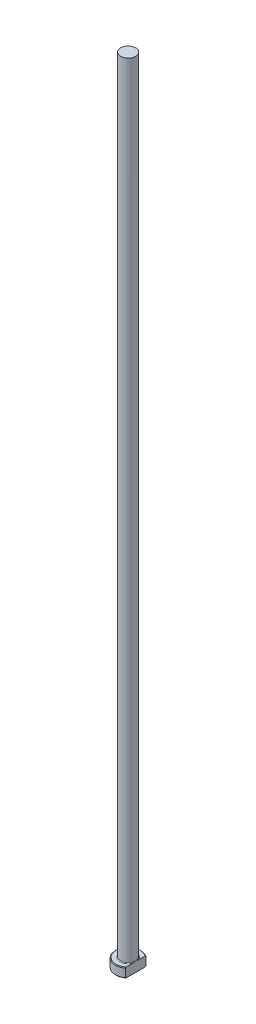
ISO-10303-21;
HEADER;
FILE_DESCRIPTION(('STEP AP214'),'2;1');
FILE_NAME('part.step','',(''),(''),'','','');
FILE_SCHEMA(('AUTOMOTIVE_DESIGN { 1 0 10303 214 1 1 1 1 }'));
ENDSEC;
DATA;
#1=APPLICATION_CONTEXT('core data for automotive mechanical design processes');
#2=APPLICATION_PROTOCOL_DEFINITION('international standard','automotive_design',2000,#1);
#3=PRODUCT_CONTEXT('',#1,'mechanical');
#4=PRODUCT('Part','Part','',(#3));
#5=PRODUCT_RELATED_PRODUCT_CATEGORY('part','',(#4));
#6=PRODUCT_DEFINITION_FORMATION('','',#4);
#7=PRODUCT_DEFINITION_CONTEXT('part definition',#1,'design');
#8=PRODUCT_DEFINITION('design','',#6,#7);
#9=PRODUCT_DEFINITION_SHAPE('','',#8);
#10=(LENGTH_UNIT() NAMED_UNIT(*) SI_UNIT(.MILLI.,.METRE.));
#11=(NAMED_UNIT(*) PLANE_ANGLE_UNIT() SI_UNIT($,.RADIAN.));
#12=(NAMED_UNIT(*) SI_UNIT($,.STERADIAN.) SOLID_ANGLE_UNIT());
#13=UNCERTAINTY_MEASURE_WITH_UNIT(LENGTH_MEASURE(1.E-05),#10,'distance_accuracy_value','');
#14=(GEOMETRIC_REPRESENTATION_CONTEXT(3) GLOBAL_UNCERTAINTY_ASSIGNED_CONTEXT((#13)) GLOBAL_UNIT_ASSIGNED_CONTEXT((#10,
#11,#12)) REPRESENTATION_CONTEXT('',''));
#15=CARTESIAN_POINT('',(0.,0.,0.));
#16=DIRECTION('',(0.,0.,1.));
#17=DIRECTION('',(1.,0.,0.));
#18=AXIS2_PLACEMENT_3D('',#15,#16,#17);
#19=CARTESIAN_POINT('',(0.,0.,0.));
#20=DIRECTION('',(0.,-1.,0.));
#21=DIRECTION('',(0.,0.,-1.));
#22=AXIS2_PLACEMENT_3D('',#19,#20,#21);
#23=PLANE('',#22);
#24=CARTESIAN_POINT('',(0.,0.,0.));
#25=DIRECTION('',(0.,-1.,0.));
#26=DIRECTION('',(0.,0.,-1.));
#27=AXIS2_PLACEMENT_3D('',#24,#25,#26);
#28=CIRCLE('',#27,3.79999999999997);
#29=CARTESIAN_POINT('',(2.34999999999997,0.,2.98621834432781));
#30=VERTEX_POINT('',#29);
#31=CARTESIAN_POINT('',(2.34999999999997,0.,-2.98621834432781));
#32=VERTEX_POINT('',#31);
#33=EDGE_CURVE('E98',#30,#32,#28,.T.);
#34=ORIENTED_EDGE('',*,*,#33,.T.);
#35=DIRECTION('',(0.,0.,1.));
#36=VECTOR('',#35,1.);
#37=CARTESIAN_POINT('',(2.34999999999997,0.,-3.23689666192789));
#38=LINE('',#37,#36);
#39=EDGE_CURVE('E83',#32,#30,#38,.T.);
#40=ORIENTED_EDGE('',*,*,#39,.T.);
#41=EDGE_LOOP('',(#34,#40));
#42=FACE_BOUND('',#41,.T.);
#43=ADVANCED_FACE('F32',(#42),#23,.T.);
#44=CARTESIAN_POINT('',(0.,259.958771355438,0.));
#45=DIRECTION('',(0.,1.,0.));
#46=DIRECTION('',(0.,0.,1.));
#47=AXIS2_PLACEMENT_3D('',#44,#45,#46);
#48=CYLINDRICAL_SURFACE('',#47,3.99999999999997);
#49=CARTESIAN_POINT('',(0.,2.80000000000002,0.));
#50=DIRECTION('',(0.,1.,0.));
#51=DIRECTION('',(0.,0.,1.));
#52=AXIS2_PLACEMENT_3D('',#49,#50,#51);
#53=CIRCLE('',#52,3.99999999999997);
#54=CARTESIAN_POINT('',(2.34999999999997,2.80000000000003,3.23689666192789));
#55=VERTEX_POINT('',#54);
#56=CARTESIAN_POINT('',(2.34999999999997,2.80000000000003,-3.23689666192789));
#57=VERTEX_POINT('',#56);
#58=EDGE_CURVE('E104',#55,#57,#53,.F.);
#59=ORIENTED_EDGE('',*,*,#58,.T.);
#60=DIRECTION('',(0.,-1.,0.));
#61=VECTOR('',#60,1.);
#62=CARTESIAN_POINT('',(2.34999999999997,250.,-3.23689666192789));
#63=LINE('',#62,#61);
#64=CARTESIAN_POINT('',(2.34999999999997,0.200000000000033,-3.23689666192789));
#65=VERTEX_POINT('',#64);
#66=EDGE_CURVE('E183',#57,#65,#63,.T.);
#67=ORIENTED_EDGE('',*,*,#66,.T.);
#68=CARTESIAN_POINT('',(0.,0.200000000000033,0.));
#69=DIRECTION('',(0.,-1.,0.));
#70=DIRECTION('',(0.,0.,-1.));
#71=AXIS2_PLACEMENT_3D('',#68,#69,#70);
#72=CIRCLE('',#71,3.99999999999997);
#73=CARTESIAN_POINT('',(2.34999999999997,0.200000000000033,3.23689666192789));
#74=VERTEX_POINT('',#73);
#75=EDGE_CURVE('E100',#65,#74,#72,.F.);
#76=ORIENTED_EDGE('',*,*,#75,.T.);
#77=DIRECTION('',(0.,-1.,0.));
#78=VECTOR('',#77,1.);
#79=CARTESIAN_POINT('',(2.34999999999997,250.,3.23689666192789));
#80=LINE('',#79,#78);
#81=EDGE_CURVE('E93',#55,#74,#80,.T.);
#82=ORIENTED_EDGE('',*,*,#81,.F.);
#83=EDGE_LOOP('',(#59,#67,#76,#82));
#84=FACE_BOUND('',#83,.T.);
#85=ADVANCED_FACE('F158',(#84),#48,.T.);
#86=CARTESIAN_POINT('',(-3.99999999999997,3.,0.));
#87=DIRECTION('',(0.,1.,0.));
#88=DIRECTION('',(0.,0.,1.));
#89=AXIS2_PLACEMENT_3D('',#86,#87,#88);
#90=PLANE('',#89);
#91=CARTESIAN_POINT('',(0.,3.,0.));
#92=DIRECTION('',(0.,1.,0.));
#93=DIRECTION('',(0.,0.,1.));
#94=AXIS2_PLACEMENT_3D('',#91,#92,#93);
#95=CIRCLE('',#94,3.8);
#96=CARTESIAN_POINT('',(2.34999999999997,3.,-2.98621834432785));
#97=VERTEX_POINT('',#96);
#98=CARTESIAN_POINT('',(2.34999999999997,3.,2.98621834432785));
#99=VERTEX_POINT('',#98);
#100=EDGE_CURVE('E178',#97,#99,#95,.T.);
#101=ORIENTED_EDGE('',*,*,#100,.T.);
#102=DIRECTION('',(0.,0.,-1.));
#103=VECTOR('',#102,1.);
#104=CARTESIAN_POINT('',(2.34999999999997,3.,0.));
#105=LINE('',#104,#103);
#106=CARTESIAN_POINT('',(2.34999999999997,2.99999999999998,0.989949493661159));
#107=VERTEX_POINT('',#106);
#108=EDGE_CURVE('E57',#99,#107,#105,.T.);
#109=ORIENTED_EDGE('',*,*,#108,.T.);
#110=CARTESIAN_POINT('',(0.,3.,0.));
#111=DIRECTION('',(0.,1.,0.));
#112=DIRECTION('',(0.,0.,1.));
#113=AXIS2_PLACEMENT_3D('',#110,#111,#112);
#114=CIRCLE('',#113,2.54999999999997);
#115=CARTESIAN_POINT('',(2.34999999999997,2.99999999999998,-0.989949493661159));
#116=VERTEX_POINT('',#115);
#117=EDGE_CURVE('E107',#107,#116,#114,.F.);
#118=ORIENTED_EDGE('',*,*,#117,.T.);
#119=EDGE_CURVE('E136',#116,#97,#105,.T.);
#120=ORIENTED_EDGE('',*,*,#119,.T.);
#121=EDGE_LOOP('',(#101,#109,#118,#120));
#122=FACE_BOUND('',#121,.T.);
#123=ADVANCED_FACE('F147',(#122),#90,.T.);
#124=CARTESIAN_POINT('',(0.,3.,0.));
#125=DIRECTION('',(0.,-1.,0.));
#126=DIRECTION('',(0.,0.,-1.));
#127=AXIS2_PLACEMENT_3D('',#124,#125,#126);
#128=CONICAL_SURFACE('',#127,3.8,0.785398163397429);
#129=ORIENTED_EDGE('',*,*,#58,.F.);
#130=CARTESIAN_POINT('',(2.34999999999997,-0.700856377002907,7.12322584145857));
#131=CARTESIAN_POINT('',(2.34999999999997,-0.585941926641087,7.00221702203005));
#132=CARTESIAN_POINT('',(2.34999999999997,-0.471176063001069,6.88106709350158));
#133=CARTESIAN_POINT('',(2.34999999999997,-0.241996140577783,6.63843358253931));
#134=CARTESIAN_POINT('',(2.34999999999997,-0.12758208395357,6.51694999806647));
#135=CARTESIAN_POINT('',(2.34999999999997,0.215169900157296,6.15179430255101));
#136=CARTESIAN_POINT('',(2.34999999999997,0.442895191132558,5.90754596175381));
#137=CARTESIAN_POINT('',(2.34999999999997,0.899497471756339,5.41318459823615));
#138=CARTESIAN_POINT('',(2.34999999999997,1.12833917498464,5.16303891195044));
#139=CARTESIAN_POINT('',(2.34999999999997,1.582411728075,4.65967689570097));
#140=CARTESIAN_POINT('',(2.34999999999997,1.80764410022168,4.40646194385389));
#141=CARTESIAN_POINT('',(2.34999999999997,2.21600221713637,3.93721563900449));
#142=CARTESIAN_POINT('',(2.34999999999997,2.39996239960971,3.72191569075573));
#143=CARTESIAN_POINT('',(2.34999999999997,2.67143803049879,3.39502060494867));
#144=CARTESIAN_POINT('',(2.34999999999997,2.76124091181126,3.28532776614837));
#145=CARTESIAN_POINT('',(2.34999999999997,2.93886030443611,3.06434945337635));
#146=CARTESIAN_POINT('',(2.34999999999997,3.02667691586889,2.95306406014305));
#147=CARTESIAN_POINT('',(2.34999999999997,3.19949645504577,2.72877711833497));
#148=CARTESIAN_POINT('',(2.34999999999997,3.28450603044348,2.61578071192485));
#149=CARTESIAN_POINT('',(2.34999999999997,3.45108912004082,2.38722377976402));
#150=CARTESIAN_POINT('',(2.34999999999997,3.53266178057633,2.27166262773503));
#151=CARTESIAN_POINT('',(2.34999999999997,3.69088588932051,2.03753037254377));
#152=CARTESIAN_POINT('',(2.34999999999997,3.76754679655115,1.91896570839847));
#153=CARTESIAN_POINT('',(2.34999999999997,3.91413135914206,1.67777357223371));
#154=CARTESIAN_POINT('',(2.34999999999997,3.98405924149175,1.55514871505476));
#155=CARTESIAN_POINT('',(2.34999999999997,4.09761312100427,1.33668409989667));
#156=CARTESIAN_POINT('',(2.34999999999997,4.14340149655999,1.24197842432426));
#157=CARTESIAN_POINT('',(2.34999999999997,4.22781425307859,1.04934973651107));
#158=CARTESIAN_POINT('',(2.34999999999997,4.26643728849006,0.951426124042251));
#159=CARTESIAN_POINT('',(2.34999999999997,4.33394568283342,0.753323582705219));
#160=CARTESIAN_POINT('',(2.34999999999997,4.36292600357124,0.653177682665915));
#161=CARTESIAN_POINT('',(2.34999999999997,4.40928787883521,0.4502347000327));
#162=CARTESIAN_POINT('',(2.34999999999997,4.42667991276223,0.347440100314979));
#163=CARTESIAN_POINT('',(2.34999999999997,4.44509392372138,0.169206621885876));
#164=CARTESIAN_POINT('',(2.34999999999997,4.44931933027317,0.0940925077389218));
#165=CARTESIAN_POINT('',(2.34999999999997,4.45052785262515,-0.0561912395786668));
#166=CARTESIAN_POINT('',(2.34999999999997,4.44751194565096,-0.131360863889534));
#167=CARTESIAN_POINT('',(2.34999999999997,4.43440638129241,-0.281306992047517));
#168=CARTESIAN_POINT('',(2.34999999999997,4.42429455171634,-0.356081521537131));
#169=CARTESIAN_POINT('',(2.34999999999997,4.39757556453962,-0.504456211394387));
#170=CARTESIAN_POINT('',(2.34999999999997,4.38096681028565,-0.578056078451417));
#171=CARTESIAN_POINT('',(2.34999999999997,4.33328847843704,-0.756675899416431));
#172=CARTESIAN_POINT('',(2.34999999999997,4.29907594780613,-0.860854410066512));
#173=CARTESIAN_POINT('',(2.34999999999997,4.22140056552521,-1.06568624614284));
#174=CARTESIAN_POINT('',(2.34999999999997,4.17793098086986,-1.16633694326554));
#175=CARTESIAN_POINT('',(2.34999999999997,4.08383876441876,-1.3648095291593));
#176=CARTESIAN_POINT('',(2.34999999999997,4.0331816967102,-1.46261489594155));
#177=CARTESIAN_POINT('',(2.34999999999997,3.95330034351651,-1.60710986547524));
#178=CARTESIAN_POINT('',(2.34999999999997,3.92602819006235,-1.65489920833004));
#179=CARTESIAN_POINT('',(2.34999999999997,3.8703483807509,-1.74981001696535));
#180=CARTESIAN_POINT('',(2.34999999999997,3.84194077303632,-1.79693151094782));
#181=CARTESIAN_POINT('',(2.34999999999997,3.74736854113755,-1.95015020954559));
#182=CARTESIAN_POINT('',(2.34999999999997,3.67916021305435,-2.05498710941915));
#183=CARTESIAN_POINT('',(2.34999999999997,3.53901640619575,-2.26214963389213));
#184=CARTESIAN_POINT('',(2.34999999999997,3.46708001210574,-2.36447463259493));
#185=CARTESIAN_POINT('',(2.34999999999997,3.32034981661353,-2.56716934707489));
#186=CARTESIAN_POINT('',(2.34999999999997,3.24555383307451,-2.66753747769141));
#187=CARTESIAN_POINT('',(2.34999999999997,3.09379905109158,-2.86662881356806));
#188=CARTESIAN_POINT('',(2.34999999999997,3.0168401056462,-2.96535190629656));
#189=CARTESIAN_POINT('',(2.34999999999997,2.78304279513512,-3.26004190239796));
#190=CARTESIAN_POINT('',(2.34999999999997,2.62367547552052,-3.45399979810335));
#191=CARTESIAN_POINT('',(2.34999999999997,2.30072524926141,-3.83818937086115));
#192=CARTESIAN_POINT('',(2.34999999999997,2.13714428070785,-4.02842269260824));
#193=CARTESIAN_POINT('',(2.34999999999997,1.80677758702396,-4.40661405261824));
#194=CARTESIAN_POINT('',(2.34999999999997,1.63998718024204,-4.59456799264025));
#195=CARTESIAN_POINT('',(2.34999999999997,1.30429273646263,-4.96860985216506));
#196=CARTESIAN_POINT('',(2.34999999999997,1.1353884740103,-5.15469756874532));
#197=CARTESIAN_POINT('',(2.34999999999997,0.796258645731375,-5.52521155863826));
#198=CARTESIAN_POINT('',(2.34999999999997,0.626035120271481,-5.70963970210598));
#199=CARTESIAN_POINT('',(2.34999999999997,0.284419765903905,-6.07741061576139));
#200=CARTESIAN_POINT('',(2.34999999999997,0.113027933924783,-6.26075338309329));
#201=CARTESIAN_POINT('',(2.34999999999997,-0.112202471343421,-6.50049374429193));
#202=CARTESIAN_POINT('',(2.34999999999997,-0.165631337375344,-6.55727687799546));
#203=CARTESIAN_POINT('',(2.34999999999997,-0.272578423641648,-6.67077412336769));
#204=CARTESIAN_POINT('',(2.34999999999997,-0.326096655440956,-6.72748822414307));
#205=CARTESIAN_POINT('',(2.34999999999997,-0.433118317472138,-6.84074875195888));
#206=CARTESIAN_POINT('',(2.34999999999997,-0.486621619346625,-6.8972953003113));
#207=CARTESIAN_POINT('',(2.34999999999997,-0.593691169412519,-7.01031353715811));
#208=CARTESIAN_POINT('',(2.34999999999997,-0.647257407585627,-7.06678523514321));
#209=CARTESIAN_POINT('',(2.34999999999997,-0.700856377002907,-7.12322584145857));
#210=B_SPLINE_CURVE_WITH_KNOTS('',3,(#130,#131,#132,#133,#134,#135,#136,#137,#138,#139,#140,
#141,#142,#143,#144,#145,#146,#147,#148,#149,#150,#151,#152,#153,#154,#155,#156,#157,#158,#159,
#160,#161,#162,#163,#164,#165,#166,#167,#168,#169,#170,#171,#172,#173,#174,#175,#176,#177,#178,
#179,#180,#181,#182,#183,#184,#185,#186,#187,#188,#189,#190,#191,#192,#193,#194,#195,#196,#197,
#198,#199,#200,#201,#202,#203,#204,#205,#206,#207,#208,#209),.UNSPECIFIED.,.F.,.F.,(4,2,2,2,2,2,
2,2,2,2,2,2,2,2,2,2,2,2,2,2,2,2,2,2,2,2,2,2,2,2,2,2,2,2,2,2,2,2,2,4),(0.,0.500635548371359,
1.00127416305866,2.00308434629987,3.02015300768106,4.03678077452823,4.88626044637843,
5.31153593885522,5.73678994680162,6.16095168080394,6.58521815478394,7.00864136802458,
7.43179699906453,7.74715928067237,8.06258072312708,8.37479699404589,8.68673054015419,
8.91210094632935,9.13744094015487,9.36348819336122,9.58959103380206,9.91793468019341,
10.2465179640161,10.5767323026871,10.7417913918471,10.9068434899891,11.2819382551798,
11.6571255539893,12.0326051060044,12.4081102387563,13.1610954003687,13.9137401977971,
14.6675815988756,15.4215040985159,16.1744305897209,16.9273590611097,17.1612622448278,
17.3951984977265,17.6287386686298,17.8622456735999),.UNSPECIFIED.);
#211=EDGE_CURVE('E135',#55,#99,#210,.T.);
#212=ORIENTED_EDGE('',*,*,#211,.T.);
#213=ORIENTED_EDGE('',*,*,#100,.F.);
#214=EDGE_CURVE('E127',#97,#57,#210,.T.);
#215=ORIENTED_EDGE('',*,*,#214,.T.);
#216=EDGE_LOOP('',(#129,#212,#213,#215));
#217=FACE_BOUND('',#216,.T.);
#218=ADVANCED_FACE('F143',(#217),#128,.T.);
#219=CARTESIAN_POINT('',(0.,0.200000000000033,0.));
#220=DIRECTION('',(0.,1.,0.));
#221=DIRECTION('',(0.,0.,1.));
#222=AXIS2_PLACEMENT_3D('',#219,#220,#221);
#223=CONICAL_SURFACE('',#222,3.99999999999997,0.785398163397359);
#224=ORIENTED_EDGE('',*,*,#75,.F.);
#225=CARTESIAN_POINT('',(2.34999999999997,3.70085637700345,-7.12322584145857));
#226=CARTESIAN_POINT('',(2.34999999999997,3.58594192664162,-7.00221702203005));
#227=CARTESIAN_POINT('',(2.34999999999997,3.47117606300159,-6.88106709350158));
#228=CARTESIAN_POINT('',(2.34999999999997,3.24199614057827,-6.63843358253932));
#229=CARTESIAN_POINT('',(2.34999999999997,3.12758208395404,-6.51694999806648));
#230=CARTESIAN_POINT('',(2.34999999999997,2.78483009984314,-6.15179430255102));
#231=CARTESIAN_POINT('',(2.34999999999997,2.55710480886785,-5.90754596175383));
#232=CARTESIAN_POINT('',(2.34999999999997,2.10050252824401,-5.41318459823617));
#233=CARTESIAN_POINT('',(2.34999999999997,1.87166082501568,-5.16303891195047));
#234=CARTESIAN_POINT('',(2.34999999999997,1.41758827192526,-4.65967689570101));
#235=CARTESIAN_POINT('',(2.34999999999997,1.19235589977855,-4.40646194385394));
#236=CARTESIAN_POINT('',(2.34999999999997,0.78399778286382,-3.93721563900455));
#237=CARTESIAN_POINT('',(2.34999999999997,0.600037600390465,-3.7219156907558));
#238=CARTESIAN_POINT('',(2.34999999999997,0.328561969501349,-3.39502060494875));
#239=CARTESIAN_POINT('',(2.34999999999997,0.23875908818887,-3.28532776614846));
#240=CARTESIAN_POINT('',(2.34999999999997,0.0611396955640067,-3.06434945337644));
#241=CARTESIAN_POINT('',(2.34999999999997,-0.0266769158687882,-2.95306406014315));
#242=CARTESIAN_POINT('',(2.34999999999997,-0.199496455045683,-2.72877711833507));
#243=CARTESIAN_POINT('',(2.34999999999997,-0.284506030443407,-2.61578071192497));
#244=CARTESIAN_POINT('',(2.34999999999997,-0.451089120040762,-2.38722377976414));
#245=CARTESIAN_POINT('',(2.34999999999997,-0.532661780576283,-2.27166262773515));
#246=CARTESIAN_POINT('',(2.34999999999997,-0.690885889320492,-2.0375303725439));
#247=CARTESIAN_POINT('',(2.34999999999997,-0.767546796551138,-1.91896570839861));
#248=CARTESIAN_POINT('',(2.34999999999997,-0.914131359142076,-1.67777357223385));
#249=CARTESIAN_POINT('',(2.34999999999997,-0.984059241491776,-1.5551487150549));
#250=CARTESIAN_POINT('',(2.34999999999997,-1.09761312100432,-1.33668409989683));
#251=CARTESIAN_POINT('',(2.34999999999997,-1.14340149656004,-1.24197842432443));
#252=CARTESIAN_POINT('',(2.34999999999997,-1.22781425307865,-1.04934973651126));
#253=CARTESIAN_POINT('',(2.34999999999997,-1.26643728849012,-0.951426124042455));
#254=CARTESIAN_POINT('',(2.34999999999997,-1.33394568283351,-0.753323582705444));
#255=CARTESIAN_POINT('',(2.34999999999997,-1.36292600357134,-0.65317768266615));
#256=CARTESIAN_POINT('',(2.34999999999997,-1.40928787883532,-0.450234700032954));
#257=CARTESIAN_POINT('',(2.34999999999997,-1.42667991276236,-0.347440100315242));
#258=CARTESIAN_POINT('',(2.34999999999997,-1.44509392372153,-0.169206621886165));
#259=CARTESIAN_POINT('',(2.34999999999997,-1.44931933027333,-0.0940925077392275));
#260=CARTESIAN_POINT('',(2.34999999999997,-1.45052785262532,0.0561912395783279));
#261=CARTESIAN_POINT('',(2.34999999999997,-1.44751194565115,0.131360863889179));
#262=CARTESIAN_POINT('',(2.34999999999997,-1.43440638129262,0.28130699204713));
#263=CARTESIAN_POINT('',(2.34999999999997,-1.42429455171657,0.356081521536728));
#264=CARTESIAN_POINT('',(2.34999999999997,-1.39757556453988,0.504456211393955));
#265=CARTESIAN_POINT('',(2.34999999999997,-1.38096681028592,0.57805607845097));
#266=CARTESIAN_POINT('',(2.34999999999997,-1.33328847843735,0.75667589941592));
#267=CARTESIAN_POINT('',(2.34999999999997,-1.29907594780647,0.860854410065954));
#268=CARTESIAN_POINT('',(2.34999999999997,-1.22140056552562,1.06568624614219));
#269=CARTESIAN_POINT('',(2.34999999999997,-1.17793098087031,1.16633694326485));
#270=CARTESIAN_POINT('',(2.34999999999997,-1.08383876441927,1.36480952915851));
#271=CARTESIAN_POINT('',(2.34999999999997,-1.03318169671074,1.46261489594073));
#272=CARTESIAN_POINT('',(2.34999999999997,-0.95330034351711,1.60710986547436));
#273=CARTESIAN_POINT('',(2.34999999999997,-0.926028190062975,1.65489920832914));
#274=CARTESIAN_POINT('',(2.34999999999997,-0.87034838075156,1.7498100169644));
#275=CARTESIAN_POINT('',(2.34999999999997,-0.841940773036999,1.79693151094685));
#276=CARTESIAN_POINT('',(2.34999999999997,-0.747368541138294,1.95015020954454));
#277=CARTESIAN_POINT('',(2.34999999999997,-0.67916021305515,2.05498710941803));
#278=CARTESIAN_POINT('',(2.34999999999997,-0.53901640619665,2.2621496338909));
#279=CARTESIAN_POINT('',(2.34999999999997,-0.467080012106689,2.36447463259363));
#280=CARTESIAN_POINT('',(2.34999999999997,-0.320349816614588,2.56716934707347));
#281=CARTESIAN_POINT('',(2.34999999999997,-0.245553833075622,2.66753747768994));
#282=CARTESIAN_POINT('',(2.34999999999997,-0.0937990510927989,2.86662881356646));
#283=CARTESIAN_POINT('',(2.34999999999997,-0.0168401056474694,2.96535190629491));
#284=CARTESIAN_POINT('',(2.34999999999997,0.216957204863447,3.26004190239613));
#285=CARTESIAN_POINT('',(2.34999999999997,0.376324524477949,3.45399979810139));
#286=CARTESIAN_POINT('',(2.34999999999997,0.699274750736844,3.83818937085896));
#287=CARTESIAN_POINT('',(2.34999999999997,0.862855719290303,4.02842269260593));
#288=CARTESIAN_POINT('',(2.34999999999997,1.19322241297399,4.40661405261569));
#289=CARTESIAN_POINT('',(2.34999999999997,1.36001281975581,4.59456799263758));
#290=CARTESIAN_POINT('',(2.34999999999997,1.69570726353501,4.96860985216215));
#291=CARTESIAN_POINT('',(2.34999999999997,1.86461152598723,5.1546975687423));
#292=CARTESIAN_POINT('',(2.34999999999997,2.20374135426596,5.52521155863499));
#293=CARTESIAN_POINT('',(2.34999999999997,2.37396487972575,5.70963970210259));
#294=CARTESIAN_POINT('',(2.34999999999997,2.71558023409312,6.07741061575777));
#295=CARTESIAN_POINT('',(2.34999999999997,2.88697206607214,6.26075338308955));
#296=CARTESIAN_POINT('',(2.34999999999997,3.11220247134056,6.50049374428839));
#297=CARTESIAN_POINT('',(2.34999999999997,3.16563133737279,6.55727687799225));
#298=CARTESIAN_POINT('',(2.34999999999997,3.27257842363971,6.67077412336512));
#299=CARTESIAN_POINT('',(2.34999999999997,3.32609665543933,6.72748822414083));
#300=CARTESIAN_POINT('',(2.34999999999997,3.43311831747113,6.84074875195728));
#301=CARTESIAN_POINT('',(2.34999999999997,3.48662161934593,6.89729530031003));
#302=CARTESIAN_POINT('',(2.34999999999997,3.59369116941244,7.01031353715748));
#303=CARTESIAN_POINT('',(2.34999999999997,3.64725740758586,7.06678523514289));
#304=CARTESIAN_POINT('',(2.34999999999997,3.70085637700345,7.12322584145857));
#305=B_SPLINE_CURVE_WITH_KNOTS('',3,(#225,#226,#227,#228,#229,#230,#231,#232,#233,#234,#235,
#236,#237,#238,#239,#240,#241,#242,#243,#244,#245,#246,#247,#248,#249,#250,#251,#252,#253,#254,
#255,#256,#257,#258,#259,#260,#261,#262,#263,#264,#265,#266,#267,#268,#269,#270,#271,#272,#273,
#274,#275,#276,#277,#278,#279,#280,#281,#282,#283,#284,#285,#286,#287,#288,#289,#290,#291,#292,
#293,#294,#295,#296,#297,#298,#299,#300,#301,#302,#303,#304),.UNSPECIFIED.,.F.,.F.,(4,2,2,2,2,2,
2,2,2,2,2,2,2,2,2,2,2,2,2,2,2,2,2,2,2,2,2,2,2,2,2,2,2,2,2,2,2,2,2,4),(0.,0.500635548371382,
1.00127416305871,2.00308434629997,3.0201530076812,4.03678077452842,4.88626044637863,
5.31153593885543,5.73678994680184,6.16095168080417,6.58521815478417,7.00864136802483,
7.43179699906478,7.7471592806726,8.06258072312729,8.37479699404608,8.68673054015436,
8.91210094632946,9.13744094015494,9.36348819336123,9.58959103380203,9.91793468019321,
10.2465179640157,10.5767323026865,10.7417913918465,10.9068434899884,11.2819382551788,
11.6571255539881,12.032605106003,12.4081102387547,13.1610954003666,13.9137401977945,
14.6675815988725,15.4215040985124,16.1744305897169,16.9273590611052,17.1612622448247,
17.3951984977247,17.6287386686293,17.8622456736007),.UNSPECIFIED.);
#306=EDGE_CURVE('E86',#65,#32,#305,.T.);
#307=ORIENTED_EDGE('',*,*,#306,.T.);
#308=ORIENTED_EDGE('',*,*,#33,.F.);
#309=EDGE_CURVE('E89',#30,#74,#305,.T.);
#310=ORIENTED_EDGE('',*,*,#309,.T.);
#311=EDGE_LOOP('',(#224,#307,#308,#310));
#312=FACE_BOUND('',#311,.T.);
#313=ADVANCED_FACE('F97',(#312),#223,.T.);
#314=CARTESIAN_POINT('',(0.,3.19999999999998,0.));
#315=DIRECTION('',(0.,1.,0.));
#316=DIRECTION('',(0.,0.,1.));
#317=AXIS2_PLACEMENT_3D('',#314,#315,#316);
#318=TOROIDAL_SURFACE('',#317,2.54999999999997,0.2);
#319=CARTESIAN_POINT('',(2.34999999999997,3.19999999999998,0.));
#320=CARTESIAN_POINT('',(2.34999999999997,3.20000050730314,3.97301146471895E-11));
#321=CARTESIAN_POINT('',(2.34999999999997,3.20000101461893,-1.63653131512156E-07));
#322=CARTESIAN_POINT('',(2.34999999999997,3.20000197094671,-6.37225615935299E-07));
#323=CARTESIAN_POINT('',(2.34999999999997,3.20000241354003,-9.56393878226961E-07));
#324=CARTESIAN_POINT('',(2.34999999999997,3.20000331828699,-1.71856519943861E-06));
#325=CARTESIAN_POINT('',(2.34999999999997,3.20000377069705,-2.17342707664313E-06));
#326=CARTESIAN_POINT('',(2.34999999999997,3.20000459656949,-3.12835726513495E-06));
#327=CARTESIAN_POINT('',(2.34999999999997,3.20000497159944,-3.62715530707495E-06));
#328=CARTESIAN_POINT('',(2.34999999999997,3.20000632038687,-5.51226929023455E-06));
#329=CARTESIAN_POINT('',(2.34999999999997,3.20000721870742,-6.95455039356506E-06));
#330=CARTESIAN_POINT('',(2.34999999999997,3.20000873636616,-9.84867466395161E-06));
#331=CARTESIAN_POINT('',(2.34999999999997,3.20000937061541,-1.1293074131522E-05));
#332=CARTESIAN_POINT('',(2.34999999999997,3.20001195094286,-1.72675053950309E-05));
#333=CARTESIAN_POINT('',(2.34999999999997,3.20001382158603,-2.18342580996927E-05));
#334=CARTESIAN_POINT('',(2.34999999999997,3.2000166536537,-3.05622351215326E-05));
#335=CARTESIAN_POINT('',(2.34999999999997,3.2000177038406,-3.46947501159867E-05));
#336=CARTESIAN_POINT('',(2.34999999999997,3.20002522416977,-6.49852707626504E-05));
#337=CARTESIAN_POINT('',(2.34999999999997,3.20003079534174,-9.13194244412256E-05));
#338=CARTESIAN_POINT('',(2.34999999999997,3.2000551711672,-0.000194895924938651));
#339=CARTESIAN_POINT('',(2.34999999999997,3.20007855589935,-0.000271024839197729));
#340=CARTESIAN_POINT('',(2.34999999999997,3.20016914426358,-0.000571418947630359));
#341=CARTESIAN_POINT('',(2.34999999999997,3.20023327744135,-0.000796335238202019));
#342=CARTESIAN_POINT('',(2.34999999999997,3.20048915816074,-0.00168650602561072));
#343=CARTESIAN_POINT('',(2.34999999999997,3.20068469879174,-0.00235093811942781));
#344=CARTESIAN_POINT('',(2.34999999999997,3.20149494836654,-0.00511204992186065));
#345=CARTESIAN_POINT('',(2.34999999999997,3.20210492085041,-0.00720975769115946));
#346=CARTESIAN_POINT('',(2.34999999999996,3.2078795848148,-0.0270590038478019));
#347=CARTESIAN_POINT('',(2.34999999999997,3.21306460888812,-0.0448062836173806));
#348=CARTESIAN_POINT('',(2.34999999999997,3.22319239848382,-0.0796159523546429));
#349=CARTESIAN_POINT('',(2.34999999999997,3.22813669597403,-0.0966779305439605));
#350=CARTESIAN_POINT('',(2.34999999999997,3.23859474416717,-0.132940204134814));
#351=CARTESIAN_POINT('',(2.34999999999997,3.24410273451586,-0.152142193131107));
#352=CARTESIAN_POINT('',(2.34999999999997,3.25508732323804,-0.190778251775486));
#353=CARTESIAN_POINT('',(2.34999999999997,3.26056294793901,-0.210212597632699));
#354=CARTESIAN_POINT('',(2.34999999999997,3.27370944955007,-0.257444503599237));
#355=CARTESIAN_POINT('',(2.34999999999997,3.28131640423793,-0.285259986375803));
#356=CARTESIAN_POINT('',(2.34999999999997,3.29598901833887,-0.340268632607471));
#357=CARTESIAN_POINT('',(2.34999999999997,3.30306356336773,-0.367459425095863));
#358=CARTESIAN_POINT('',(2.34999999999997,3.32130563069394,-0.439911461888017));
#359=CARTESIAN_POINT('',(2.34999999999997,3.33209700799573,-0.485269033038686));
#360=CARTESIAN_POINT('',(2.34999999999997,3.35207859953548,-0.576761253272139));
#361=CARTESIAN_POINT('',(2.34999999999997,3.36125388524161,-0.622899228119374));
#362=CARTESIAN_POINT('',(2.34999999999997,3.37792670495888,-0.719572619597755));
#363=CARTESIAN_POINT('',(2.34999999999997,3.3852125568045,-0.770145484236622));
#364=CARTESIAN_POINT('',(2.34999999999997,3.39588167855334,-0.87157933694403));
#365=CARTESIAN_POINT('',(2.34999999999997,3.39927813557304,-0.92243876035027));
#366=CARTESIAN_POINT('',(2.34999999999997,3.4002008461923,-0.998268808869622));
#367=CARTESIAN_POINT('',(2.34999999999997,3.39983763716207,-1.02321254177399));
#368=CARTESIAN_POINT('',(2.34999999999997,3.39747624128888,-1.07301750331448));
#369=CARTESIAN_POINT('',(2.34999999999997,3.3954790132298,-1.09787877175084));
#370=CARTESIAN_POINT('',(2.34999999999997,3.38951136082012,-1.14688451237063));
#371=CARTESIAN_POINT('',(2.34999999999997,3.38557982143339,-1.17103355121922));
#372=CARTESIAN_POINT('',(2.34999999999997,3.37522613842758,-1.21877292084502));
#373=CARTESIAN_POINT('',(2.34999999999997,3.36880975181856,-1.24236441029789));
#374=CARTESIAN_POINT('',(2.34999999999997,3.3551050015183,-1.28139211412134));
#375=CARTESIAN_POINT('',(2.34999999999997,3.34867539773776,-1.29712639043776));
#376=CARTESIAN_POINT('',(2.34999999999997,3.33376103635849,-1.32763329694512));
#377=CARTESIAN_POINT('',(2.34999999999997,3.32527759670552,-1.34240653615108));
#378=CARTESIAN_POINT('',(2.34999999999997,3.30996401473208,-1.36406737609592));
#379=CARTESIAN_POINT('',(2.34999999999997,3.30402750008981,-1.37158321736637));
#380=CARTESIAN_POINT('',(2.34999999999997,3.29119867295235,-1.38575961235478));
#381=CARTESIAN_POINT('',(2.34999999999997,3.28430748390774,-1.39242115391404));
#382=CARTESIAN_POINT('',(2.34999999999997,3.27111764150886,-1.40316348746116));
#383=CARTESIAN_POINT('',(2.34999999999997,3.26502095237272,-1.40748979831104));
#384=CARTESIAN_POINT('',(2.34999999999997,3.25221216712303,-1.41511389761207));
#385=CARTESIAN_POINT('',(2.34999999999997,3.24550106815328,-1.41841331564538));
#386=CARTESIAN_POINT('',(2.34999999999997,3.23285600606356,-1.42321218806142));
#387=CARTESIAN_POINT('',(2.34999999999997,3.22700595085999,-1.42493102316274));
#388=CARTESIAN_POINT('',(2.34999999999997,3.21509932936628,-1.42735933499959));
#389=CARTESIAN_POINT('',(2.34999999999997,3.20904291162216,-1.42806952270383));
#390=CARTESIAN_POINT('',(2.34999999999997,3.19688696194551,-1.42841721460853));
#391=CARTESIAN_POINT('',(2.34999999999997,3.19078736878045,-1.42805261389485));
#392=CARTESIAN_POINT('',(2.34999999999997,3.17874187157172,-1.42628029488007));
#393=CARTESIAN_POINT('',(2.34999999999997,3.17279604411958,-1.42487206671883));
#394=CARTESIAN_POINT('',(2.34999999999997,3.16130302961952,-1.42116093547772));
#395=CARTESIAN_POINT('',(2.34999999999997,3.15575093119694,-1.41887295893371));
#396=CARTESIAN_POINT('',(2.34999999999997,3.1450217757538,-1.41355066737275));
#397=CARTESIAN_POINT('',(2.34999999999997,3.13984483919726,-1.41051611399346));
#398=CARTESIAN_POINT('',(2.34999999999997,3.12662898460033,-1.40165617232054));
#399=CARTESIAN_POINT('',(2.34999999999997,3.11894184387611,-1.39530630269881));
#400=CARTESIAN_POINT('',(2.34999999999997,3.10463862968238,-1.38149172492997));
#401=CARTESIAN_POINT('',(2.34999999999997,3.098026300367,-1.3740232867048));
#402=CARTESIAN_POINT('',(2.34999999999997,3.08144643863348,-1.35283380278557));
#403=CARTESIAN_POINT('',(2.34999999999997,3.07238753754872,-1.33840776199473));
#404=CARTESIAN_POINT('',(2.34999999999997,3.05644883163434,-1.30845169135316));
#405=CARTESIAN_POINT('',(2.34999999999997,3.04957029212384,-1.29292102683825));
#406=CARTESIAN_POINT('',(2.34999999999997,3.03757508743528,-1.26136930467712));
#407=CARTESIAN_POINT('',(2.34999999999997,3.03244275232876,-1.24535409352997));
#408=CARTESIAN_POINT('',(2.34999999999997,3.02353297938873,-1.21294404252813));
#409=CARTESIAN_POINT('',(2.34999999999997,3.01975697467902,-1.19654882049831));
#410=CARTESIAN_POINT('',(2.34999999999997,3.01003121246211,-1.14664956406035));
#411=CARTESIAN_POINT('',(2.34999999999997,3.00581272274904,-1.11281111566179));
#412=CARTESIAN_POINT('',(2.34999999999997,2.9993669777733,-1.02798337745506));
#413=CARTESIAN_POINT('',(2.34999999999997,2.99918477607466,-0.976864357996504));
#414=CARTESIAN_POINT('',(2.34999999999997,3.00375848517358,-0.874705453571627));
#415=CARTESIAN_POINT('',(2.34999999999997,3.00853512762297,-0.823666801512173));
#416=CARTESIAN_POINT('',(2.34999999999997,3.02118536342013,-0.725382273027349));
#417=CARTESIAN_POINT('',(2.34999999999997,3.02883644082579,-0.678106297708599));
#418=CARTESIAN_POINT('',(2.34999999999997,3.04631118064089,-0.584387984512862));
#419=CARTESIAN_POINT('',(2.34999999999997,3.05611566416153,-0.537941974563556));
#420=CARTESIAN_POINT('',(2.34999999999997,3.07458329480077,-0.457342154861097));
#421=CARTESIAN_POINT('',(2.34999999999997,3.08288953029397,-0.423104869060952));
#422=CARTESIAN_POINT('',(2.34999999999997,3.100392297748,-0.353909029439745));
#423=CARTESIAN_POINT('',(2.34999999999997,3.10960639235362,-0.318954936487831));
#424=CARTESIAN_POINT('',(2.34999999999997,3.12565453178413,-0.259778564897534));
#425=CARTESIAN_POINT('',(2.34999999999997,3.13236140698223,-0.235521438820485));
#426=CARTESIAN_POINT('',(2.34999999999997,3.14587896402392,-0.187317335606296));
#427=CARTESIAN_POINT('',(2.34999999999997,3.15268775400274,-0.16336982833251));
#428=CARTESIAN_POINT('',(2.34999999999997,3.16564916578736,-0.118168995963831));
#429=CARTESIAN_POINT('',(2.34999999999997,3.17179049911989,-0.0969123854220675));
#430=CARTESIAN_POINT('',(2.34999999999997,3.18438963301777,-0.0535409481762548));
#431=CARTESIAN_POINT('',(2.34999999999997,3.19085004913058,-0.0314268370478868));
#432=CARTESIAN_POINT('',(2.34999999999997,3.19789544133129,-0.00720839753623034));
#433=CARTESIAN_POINT('',(2.34999999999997,3.1985058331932,-0.00510934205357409));
#434=CARTESIAN_POINT('',(2.34999999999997,3.19931618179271,-0.00234791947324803));
#435=CARTESIAN_POINT('',(2.34999999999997,3.19951141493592,-0.00168452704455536));
#436=CARTESIAN_POINT('',(2.34999999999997,3.1997669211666,-0.000795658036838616));
#437=CARTESIAN_POINT('',(2.34999999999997,3.19983097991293,-0.000571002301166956));
#438=CARTESIAN_POINT('',(2.34999999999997,3.19992147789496,-0.000270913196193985));
#439=CARTESIAN_POINT('',(2.34999999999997,3.19994484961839,-0.000194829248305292));
#440=CARTESIAN_POINT('',(2.34999999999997,3.19996921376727,-9.13049088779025E-05));
#441=CARTESIAN_POINT('',(2.34999999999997,3.19997478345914,-6.49772799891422E-05));
#442=CARTESIAN_POINT('',(2.34999999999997,3.19998230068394,-3.46933684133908E-05));
#443=CARTESIAN_POINT('',(2.34999999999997,3.19998335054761,-3.05612366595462E-05));
#444=CARTESIAN_POINT('',(2.34999999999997,3.19998618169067,-2.1834026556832E-05));
#445=CARTESIAN_POINT('',(2.34999999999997,3.19998805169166,-1.7267637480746E-05));
#446=CARTESIAN_POINT('',(2.34999999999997,3.19999063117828,-1.12935765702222E-05));
#447=CARTESIAN_POINT('',(2.34999999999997,3.19999126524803,-9.84920577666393E-06));
#448=CARTESIAN_POINT('',(2.34999999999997,3.19999278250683,-6.95510752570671E-06));
#449=CARTESIAN_POINT('',(2.34999999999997,3.19999368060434,-5.51282056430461E-06));
#450=CARTESIAN_POINT('',(2.34999999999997,3.1999950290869,-3.62766169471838E-06));
#451=CARTESIAN_POINT('',(2.34999999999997,3.19999540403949,-3.12884229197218E-06));
#452=CARTESIAN_POINT('',(2.34999999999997,3.19999622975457,-2.17385542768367E-06));
#453=CARTESIAN_POINT('',(2.34999999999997,3.19999668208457,-1.7189578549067E-06));
#454=CARTESIAN_POINT('',(2.34999999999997,3.19999758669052,-9.56701781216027E-07));
#455=CARTESIAN_POINT('',(2.34999999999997,3.19999802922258,-6.37487274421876E-07));
#456=CARTESIAN_POINT('',(2.34999999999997,3.19999898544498,-1.63799560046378E-07));
#457=CARTESIAN_POINT('',(2.34999999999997,3.19999949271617,-3.97285993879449E-11));
#458=CARTESIAN_POINT('',(2.34999999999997,3.19999999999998,0.));
#459=B_SPLINE_CURVE_WITH_KNOTS('',3,(#319,#320,#321,#322,#323,#324,#325,#326,#327,#328,#329,
#330,#331,#332,#333,#334,#335,#336,#337,#338,#339,#340,#341,#342,#343,#344,#345,#346,#347,#348,
#349,#350,#351,#352,#353,#354,#355,#356,#357,#358,#359,#360,#361,#362,#363,#364,#365,#366,#367,
#368,#369,#370,#371,#372,#373,#374,#375,#376,#377,#378,#379,#380,#381,#382,#383,#384,#385,#386,
#387,#388,#389,#390,#391,#392,#393,#394,#395,#396,#397,#398,#399,#400,#401,#402,#403,#404,#405,
#406,#407,#408,#409,#410,#411,#412,#413,#414,#415,#416,#417,#418,#419,#420,#421,#422,#423,#424,
#425,#426,#427,#428,#429,#430,#431,#432,#433,#434,#435,#436,#437,#438,#439,#440,#441,#442,#443,
#444,#445,#446,#447,#448,#449,#450,#451,#452,#453,#454,#455,#456,#457,#458),.UNSPECIFIED.,.T.,
.F.,(4,2,2,2,2,2,2,2,2,2,2,2,2,2,2,2,2,2,2,2,2,2,2,2,2,2,2,2,2,2,2,2,2,2,2,2,2,2,2,2,2,2,2,2,2,
2,2,2,2,2,2,2,2,2,2,2,2,2,2,2,2,2,2,2,2,2,2,2,2,4),(0.,1.52815232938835E-06,
3.16151347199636E-06,5.07598848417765E-06,6.9467232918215E-06,1.2023610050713E-05,
1.67522119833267E-05,3.15258107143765E-05,4.43009343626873E-05,0.000125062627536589,
0.000363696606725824,0.00106562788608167,0.00314310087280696,0.00969727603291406,
0.0651627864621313,0.118455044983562,0.178383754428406,0.238956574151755,0.325465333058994,
0.409751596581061,0.549599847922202,0.69067896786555,0.843870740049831,0.99654155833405,
1.07134060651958,1.14609579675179,1.21940608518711,1.29254753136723,1.3434432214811,
1.39430633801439,1.42297722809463,1.45161466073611,1.47396609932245,1.49628188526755,
1.51449565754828,1.5326965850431,1.55093318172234,1.56917869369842,1.58712740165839,
1.60508184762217,1.63482087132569,1.66466136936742,1.71547705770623,1.76632218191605,
1.81669819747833,1.86712728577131,1.96917546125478,2.12216244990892,2.27579162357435,
2.41939223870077,2.56176232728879,2.667446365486,2.77588510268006,2.85138624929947,
2.92607549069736,2.99245400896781,3.06156674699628,3.06812515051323,3.07019937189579,
3.07090048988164,3.07113898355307,3.07121972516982,3.07123249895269,3.07124727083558,
3.07125199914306,3.07125707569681,3.07125894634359,3.07126086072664,3.07126249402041,
3.07126402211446),.UNSPECIFIED.);
#460=CARTESIAN_POINT('',(2.34999999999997,3.19999999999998,0.));
#461=VERTEX_POINT('',#460);
#462=EDGE_CURVE('E11',#116,#461,#459,.T.);
#463=ORIENTED_EDGE('',*,*,#462,.F.);
#464=ORIENTED_EDGE('',*,*,#117,.F.);
#465=CARTESIAN_POINT('',(2.34999999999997,3.19999999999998,0.));
#466=CARTESIAN_POINT('',(2.34999999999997,3.19999949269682,-3.97300613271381E-11));
#467=CARTESIAN_POINT('',(2.34999999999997,3.19999898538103,1.63653131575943E-07));
#468=CARTESIAN_POINT('',(2.34999999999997,3.19999802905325,6.37225615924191E-07));
#469=CARTESIAN_POINT('',(2.34999999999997,3.19999758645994,9.56393878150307E-07));
#470=CARTESIAN_POINT('',(2.34999999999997,3.19999668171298,1.71856519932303E-06));
#471=CARTESIAN_POINT('',(2.34999999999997,3.19999622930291,2.17342707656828E-06));
#472=CARTESIAN_POINT('',(2.34999999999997,3.19999540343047,3.12835726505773E-06));
#473=CARTESIAN_POINT('',(2.34999999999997,3.19999502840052,3.62715530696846E-06));
#474=CARTESIAN_POINT('',(2.34999999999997,3.19999367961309,5.51226928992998E-06));
#475=CARTESIAN_POINT('',(2.34999999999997,3.19999278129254,6.95455039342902E-06));
#476=CARTESIAN_POINT('',(2.34999999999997,3.1999912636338,9.84867466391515E-06));
#477=CARTESIAN_POINT('',(2.34999999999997,3.19999062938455,1.12930741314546E-05));
#478=CARTESIAN_POINT('',(2.34999999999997,3.1999880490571,1.72675053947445E-05));
#479=CARTESIAN_POINT('',(2.34999999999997,3.19998617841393,2.18342580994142E-05));
#480=CARTESIAN_POINT('',(2.34999999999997,3.19998334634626,3.0562235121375E-05));
#481=CARTESIAN_POINT('',(2.34999999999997,3.19998229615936,3.46947501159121E-05));
#482=CARTESIAN_POINT('',(2.34999999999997,3.19997477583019,6.49852707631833E-05));
#483=CARTESIAN_POINT('',(2.34999999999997,3.19996920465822,9.13194244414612E-05));
#484=CARTESIAN_POINT('',(2.34999999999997,3.19994482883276,0.000194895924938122));
#485=CARTESIAN_POINT('',(2.34999999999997,3.19992144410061,0.000271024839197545));
#486=CARTESIAN_POINT('',(2.34999999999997,3.19983085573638,0.000571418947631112));
#487=CARTESIAN_POINT('',(2.34999999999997,3.19976672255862,0.000796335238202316));
#488=CARTESIAN_POINT('',(2.34999999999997,3.19951084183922,0.00168650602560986));
#489=CARTESIAN_POINT('',(2.34999999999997,3.19931530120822,0.00235093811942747));
#490=CARTESIAN_POINT('',(2.34999999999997,3.19850505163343,0.00511204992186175));
#491=CARTESIAN_POINT('',(2.34999999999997,3.19789507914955,0.00720975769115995));
#492=CARTESIAN_POINT('',(2.34999999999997,3.19212041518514,0.0270590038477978));
#493=CARTESIAN_POINT('',(2.34999999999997,3.18693539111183,0.0448062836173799));
#494=CARTESIAN_POINT('',(2.34999999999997,3.17680760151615,0.0796159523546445));
#495=CARTESIAN_POINT('',(2.34999999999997,3.17186330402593,0.0966779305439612));
#496=CARTESIAN_POINT('',(2.34999999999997,3.16140525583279,0.132940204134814));
#497=CARTESIAN_POINT('',(2.34999999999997,3.1558972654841,0.152142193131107));
#498=CARTESIAN_POINT('',(2.34999999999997,3.14491267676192,0.190778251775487));
#499=CARTESIAN_POINT('',(2.34999999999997,3.13943705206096,0.210212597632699));
#500=CARTESIAN_POINT('',(2.34999999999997,3.12629055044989,0.257444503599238));
#501=CARTESIAN_POINT('',(2.34999999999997,3.11868359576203,0.285259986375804));
#502=CARTESIAN_POINT('',(2.34999999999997,3.10401098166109,0.340268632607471));
#503=CARTESIAN_POINT('',(2.34999999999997,3.09693643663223,0.367459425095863));
#504=CARTESIAN_POINT('',(2.34999999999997,3.07869436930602,0.439911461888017));
#505=CARTESIAN_POINT('',(2.34999999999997,3.06790299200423,0.485269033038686));
#506=CARTESIAN_POINT('',(2.34999999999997,3.04792140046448,0.576761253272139));
#507=CARTESIAN_POINT('',(2.34999999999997,3.03874611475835,0.622899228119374));
#508=CARTESIAN_POINT('',(2.34999999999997,3.02207329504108,0.719572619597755));
#509=CARTESIAN_POINT('',(2.34999999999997,3.01478744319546,0.770145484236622));
#510=CARTESIAN_POINT('',(2.34999999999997,3.00411832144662,0.87157933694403));
#511=CARTESIAN_POINT('',(2.34999999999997,3.00072186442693,0.92243876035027));
#512=CARTESIAN_POINT('',(2.34999999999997,2.99979915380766,0.998268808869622));
#513=CARTESIAN_POINT('',(2.34999999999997,3.00016236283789,1.02321254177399));
#514=CARTESIAN_POINT('',(2.34999999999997,3.00252375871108,1.07301750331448));
#515=CARTESIAN_POINT('',(2.34999999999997,3.00452098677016,1.09787877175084));
#516=CARTESIAN_POINT('',(2.34999999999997,3.01048863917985,1.14688451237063));
#517=CARTESIAN_POINT('',(2.34999999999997,3.01442017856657,1.17103355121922));
#518=CARTESIAN_POINT('',(2.34999999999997,3.02477386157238,1.21877292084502));
#519=CARTESIAN_POINT('',(2.34999999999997,3.0311902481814,1.24236441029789));
#520=CARTESIAN_POINT('',(2.34999999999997,3.04489499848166,1.28139211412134));
#521=CARTESIAN_POINT('',(2.34999999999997,3.0513246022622,1.29712639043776));
#522=CARTESIAN_POINT('',(2.34999999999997,3.06623896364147,1.32763329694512));
#523=CARTESIAN_POINT('',(2.34999999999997,3.07472240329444,1.34240653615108));
#524=CARTESIAN_POINT('',(2.34999999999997,3.09003598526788,1.36406737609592));
#525=CARTESIAN_POINT('',(2.34999999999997,3.09597249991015,1.37158321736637));
#526=CARTESIAN_POINT('',(2.34999999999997,3.10880132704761,1.38575961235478));
#527=CARTESIAN_POINT('',(2.34999999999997,3.11569251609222,1.39242115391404));
#528=CARTESIAN_POINT('',(2.34999999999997,3.1288823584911,1.40316348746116));
#529=CARTESIAN_POINT('',(2.34999999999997,3.13497904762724,1.40748979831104));
#530=CARTESIAN_POINT('',(2.34999999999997,3.14778783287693,1.41511389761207));
#531=CARTESIAN_POINT('',(2.34999999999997,3.15449893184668,1.41841331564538));
#532=CARTESIAN_POINT('',(2.34999999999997,3.1671439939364,1.42321218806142));
#533=CARTESIAN_POINT('',(2.34999999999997,3.17299404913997,1.42493102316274));
#534=CARTESIAN_POINT('',(2.34999999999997,3.18490067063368,1.42735933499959));
#535=CARTESIAN_POINT('',(2.34999999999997,3.19095708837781,1.42806952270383));
#536=CARTESIAN_POINT('',(2.34999999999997,3.20311303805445,1.42841721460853));
#537=CARTESIAN_POINT('',(2.34999999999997,3.20921263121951,1.42805261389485));
#538=CARTESIAN_POINT('',(2.34999999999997,3.22125812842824,1.42628029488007));
#539=CARTESIAN_POINT('',(2.34999999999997,3.22720395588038,1.42487206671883));
#540=CARTESIAN_POINT('',(2.34999999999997,3.23869697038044,1.42116093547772));
#541=CARTESIAN_POINT('',(2.34999999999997,3.24424906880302,1.41887295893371));
#542=CARTESIAN_POINT('',(2.34999999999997,3.25497822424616,1.41355066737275));
#543=CARTESIAN_POINT('',(2.34999999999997,3.26015516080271,1.41051611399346));
#544=CARTESIAN_POINT('',(2.34999999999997,3.27337101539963,1.40165617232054));
#545=CARTESIAN_POINT('',(2.34999999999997,3.28105815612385,1.39530630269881));
#546=CARTESIAN_POINT('',(2.34999999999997,3.29536137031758,1.38149172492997));
#547=CARTESIAN_POINT('',(2.34999999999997,3.30197369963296,1.3740232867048));
#548=CARTESIAN_POINT('',(2.34999999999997,3.31855356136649,1.35283380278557));
#549=CARTESIAN_POINT('',(2.34999999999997,3.32761246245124,1.33840776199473));
#550=CARTESIAN_POINT('',(2.34999999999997,3.34355116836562,1.30845169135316));
#551=CARTESIAN_POINT('',(2.34999999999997,3.35042970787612,1.29292102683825));
#552=CARTESIAN_POINT('',(2.34999999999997,3.36242491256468,1.26136930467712));
#553=CARTESIAN_POINT('',(2.34999999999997,3.36755724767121,1.24535409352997));
#554=CARTESIAN_POINT('',(2.34999999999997,3.37646702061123,1.21294404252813));
#555=CARTESIAN_POINT('',(2.34999999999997,3.38024302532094,1.19654882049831));
#556=CARTESIAN_POINT('',(2.34999999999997,3.38996878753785,1.14664956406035));
#557=CARTESIAN_POINT('',(2.34999999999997,3.39418727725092,1.11281111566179));
#558=CARTESIAN_POINT('',(2.34999999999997,3.40063302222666,1.02798337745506));
#559=CARTESIAN_POINT('',(2.34999999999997,3.4008152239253,0.976864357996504));
#560=CARTESIAN_POINT('',(2.34999999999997,3.39624151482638,0.874705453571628));
#561=CARTESIAN_POINT('',(2.34999999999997,3.39146487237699,0.823666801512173));
#562=CARTESIAN_POINT('',(2.34999999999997,3.37881463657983,0.72538227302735));
#563=CARTESIAN_POINT('',(2.34999999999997,3.37116355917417,0.678106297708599));
#564=CARTESIAN_POINT('',(2.34999999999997,3.35368881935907,0.584387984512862));
#565=CARTESIAN_POINT('',(2.34999999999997,3.34388433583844,0.537941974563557));
#566=CARTESIAN_POINT('',(2.34999999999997,3.32541670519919,0.457342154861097));
#567=CARTESIAN_POINT('',(2.34999999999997,3.31711046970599,0.423104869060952));
#568=CARTESIAN_POINT('',(2.34999999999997,3.29960770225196,0.353909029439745));
#569=CARTESIAN_POINT('',(2.34999999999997,3.29039360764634,0.318954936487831));
#570=CARTESIAN_POINT('',(2.34999999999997,3.27434546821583,0.259778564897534));
#571=CARTESIAN_POINT('',(2.34999999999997,3.26763859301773,0.235521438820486));
#572=CARTESIAN_POINT('',(2.34999999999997,3.25412103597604,0.187317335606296));
#573=CARTESIAN_POINT('',(2.34999999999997,3.24731224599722,0.16336982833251));
#574=CARTESIAN_POINT('',(2.34999999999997,3.2343508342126,0.118168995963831));
#575=CARTESIAN_POINT('',(2.34999999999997,3.22820950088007,0.0969123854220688));
#576=CARTESIAN_POINT('',(2.34999999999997,3.21561036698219,0.053540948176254));
#577=CARTESIAN_POINT('',(2.34999999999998,3.20914995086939,0.0314268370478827));
#578=CARTESIAN_POINT('',(2.34999999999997,3.20210455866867,0.00720839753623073));
#579=CARTESIAN_POINT('',(2.34999999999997,3.20149416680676,0.00510934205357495));
#580=CARTESIAN_POINT('',(2.34999999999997,3.20068381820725,0.0023479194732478));
#581=CARTESIAN_POINT('',(2.34999999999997,3.20048858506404,0.00168452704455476));
#582=CARTESIAN_POINT('',(2.34999999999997,3.20023307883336,0.000795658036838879));
#583=CARTESIAN_POINT('',(2.34999999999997,3.20016902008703,0.000571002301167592));
#584=CARTESIAN_POINT('',(2.34999999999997,3.200078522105,0.000270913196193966));
#585=CARTESIAN_POINT('',(2.34999999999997,3.20005515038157,0.000194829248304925));
#586=CARTESIAN_POINT('',(2.34999999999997,3.20003078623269,9.13049088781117E-05));
#587=CARTESIAN_POINT('',(2.34999999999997,3.20002521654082,6.49772799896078E-05));
#588=CARTESIAN_POINT('',(2.34999999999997,3.20001769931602,3.46933684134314E-05));
#589=CARTESIAN_POINT('',(2.34999999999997,3.20001664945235,3.05612366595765E-05));
#590=CARTESIAN_POINT('',(2.34999999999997,3.20001381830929,2.18340265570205E-05));
#591=CARTESIAN_POINT('',(2.34999999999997,3.2000119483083,1.72676374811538E-05));
#592=CARTESIAN_POINT('',(2.34999999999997,3.20000936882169,1.1293576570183E-05));
#593=CARTESIAN_POINT('',(2.34999999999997,3.20000873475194,9.84920577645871E-06));
#594=CARTESIAN_POINT('',(2.34999999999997,3.20000721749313,6.95510752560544E-06));
#595=CARTESIAN_POINT('',(2.34999999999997,3.20000631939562,5.51282056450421E-06));
#596=CARTESIAN_POINT('',(2.34999999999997,3.20000497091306,3.62766169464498E-06));
#597=CARTESIAN_POINT('',(2.34999999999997,3.20000459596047,3.12884229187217E-06));
#598=CARTESIAN_POINT('',(2.34999999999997,3.20000377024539,2.17385542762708E-06));
#599=CARTESIAN_POINT('',(2.34999999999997,3.2000033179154,1.71895785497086E-06));
#600=CARTESIAN_POINT('',(2.34999999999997,3.20000241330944,9.56701781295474E-07));
#601=CARTESIAN_POINT('',(2.34999999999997,3.20000197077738,6.37487274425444E-07));
#602=CARTESIAN_POINT('',(2.34999999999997,3.20000101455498,1.63799559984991E-07));
#603=CARTESIAN_POINT('',(2.34999999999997,3.20000050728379,3.97285460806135E-11));
#604=CARTESIAN_POINT('',(2.34999999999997,3.19999999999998,0.));
#605=B_SPLINE_CURVE_WITH_KNOTS('',3,(#465,#466,#467,#468,#469,#470,#471,#472,#473,#474,#475,
#476,#477,#478,#479,#480,#481,#482,#483,#484,#485,#486,#487,#488,#489,#490,#491,#492,#493,#494,
#495,#496,#497,#498,#499,#500,#501,#502,#503,#504,#505,#506,#507,#508,#509,#510,#511,#512,#513,
#514,#515,#516,#517,#518,#519,#520,#521,#522,#523,#524,#525,#526,#527,#528,#529,#530,#531,#532,
#533,#534,#535,#536,#537,#538,#539,#540,#541,#542,#543,#544,#545,#546,#547,#548,#549,#550,#551,
#552,#553,#554,#555,#556,#557,#558,#559,#560,#561,#562,#563,#564,#565,#566,#567,#568,#569,#570,
#571,#572,#573,#574,#575,#576,#577,#578,#579,#580,#581,#582,#583,#584,#585,#586,#587,#588,#589,
#590,#591,#592,#593,#594,#595,#596,#597,#598,#599,#600,#601,#602,#603,#604),.UNSPECIFIED.,.T.,
.F.,(4,2,2,2,2,2,2,2,2,2,2,2,2,2,2,2,2,2,2,2,2,2,2,2,2,2,2,2,2,2,2,2,2,2,2,2,2,2,2,2,2,2,2,2,2,
2,2,2,2,2,2,2,2,2,2,2,2,2,2,2,2,2,2,2,2,2,2,2,2,4),(0.,1.52815232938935E-06,
3.16151347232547E-06,5.07598848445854E-06,6.94672329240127E-06,1.20236100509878E-05,
1.67522119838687E-05,3.1525810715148E-05,4.43009343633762E-05,0.000125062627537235,
0.000363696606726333,0.00106562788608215,0.00314310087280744,0.00969727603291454,
0.0651627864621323,0.118455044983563,0.178383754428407,0.238956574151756,0.325465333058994,
0.409751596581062,0.549599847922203,0.69067896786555,0.843870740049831,0.996541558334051,
1.07134060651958,1.14609579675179,1.21940608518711,1.29254753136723,1.3434432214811,
1.39430633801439,1.42297722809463,1.45161466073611,1.47396609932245,1.49628188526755,
1.51449565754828,1.5326965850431,1.55093318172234,1.56917869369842,1.58712740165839,
1.60508184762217,1.63482087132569,1.66466136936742,1.71547705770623,1.76632218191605,
1.81669819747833,1.86712728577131,1.96917546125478,2.12216244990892,2.27579162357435,
2.41939223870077,2.56176232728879,2.667446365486,2.77588510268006,2.85138624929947,
2.92607549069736,2.99245400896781,3.06156674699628,3.06812515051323,3.07019937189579,
3.07090048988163,3.07113898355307,3.07121972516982,3.07123249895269,3.07124727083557,
3.07125199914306,3.07125707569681,3.07125894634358,3.07126086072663,3.07126249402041,
3.07126402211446),.UNSPECIFIED.);
#606=EDGE_CURVE('E46',#461,#107,#605,.T.);
#607=ORIENTED_EDGE('',*,*,#606,.F.);
#608=CARTESIAN_POINT('',(0.,3.19999999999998,0.));
#609=DIRECTION('',(0.,1.,0.));
#610=DIRECTION('',(0.,0.,1.));
#611=AXIS2_PLACEMENT_3D('',#608,#609,#610);
#612=CIRCLE('',#611,2.34999999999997);
#613=EDGE_CURVE('E103',#461,#461,#612,.T.);
#614=ORIENTED_EDGE('',*,*,#613,.F.);
#615=EDGE_LOOP('',(#463,#464,#607,#614));
#616=FACE_BOUND('',#615,.T.);
#617=ADVANCED_FACE('F34',(#616),#318,.F.);
#618=CARTESIAN_POINT('',(0.,259.958771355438,0.));
#619=DIRECTION('',(0.,1.,0.));
#620=DIRECTION('',(0.,0.,1.));
#621=AXIS2_PLACEMENT_3D('',#618,#619,#620);
#622=CYLINDRICAL_SURFACE('',#621,2.34999999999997);
#623=ORIENTED_EDGE('',*,*,#613,.T.);
#624=EDGE_LOOP('',(#623));
#625=FACE_BOUND('',#624,.T.);
#626=CARTESIAN_POINT('',(0.,250.,0.));
#627=DIRECTION('',(0.,1.,0.));
#628=DIRECTION('',(0.,0.,1.));
#629=AXIS2_PLACEMENT_3D('',#626,#627,#628);
#630=CIRCLE('',#629,2.34999999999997);
#631=CARTESIAN_POINT('',(0.,250.,2.34999999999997));
#632=VERTEX_POINT('',#631);
#633=EDGE_CURVE('E101',#632,#632,#630,.T.);
#634=ORIENTED_EDGE('',*,*,#633,.F.);
#635=EDGE_LOOP('',(#634));
#636=FACE_BOUND('',#635,.T.);
#637=ADVANCED_FACE('F155',(#625,#636),#622,.T.);
#638=CARTESIAN_POINT('',(-2.34999999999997,250.,0.));
#639=DIRECTION('',(0.,1.,0.));
#640=DIRECTION('',(0.,0.,1.));
#641=AXIS2_PLACEMENT_3D('',#638,#639,#640);
#642=PLANE('',#641);
#643=ORIENTED_EDGE('',*,*,#633,.T.);
#644=EDGE_LOOP('',(#643));
#645=FACE_BOUND('',#644,.T.);
#646=ADVANCED_FACE('F121',(#645),#642,.T.);
#647=CARTESIAN_POINT('',(2.34999999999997,250.,-3.23689666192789));
#648=DIRECTION('',(1.,0.,0.));
#649=DIRECTION('',(0.,0.,-1.));
#650=AXIS2_PLACEMENT_3D('',#647,#648,#649);
#651=PLANE('',#650);
#652=ORIENTED_EDGE('',*,*,#66,.F.);
#653=ORIENTED_EDGE('',*,*,#214,.F.);
#654=ORIENTED_EDGE('',*,*,#119,.F.);
#655=ORIENTED_EDGE('',*,*,#462,.T.);
#656=ORIENTED_EDGE('',*,*,#606,.T.);
#657=ORIENTED_EDGE('',*,*,#108,.F.);
#658=ORIENTED_EDGE('',*,*,#211,.F.);
#659=ORIENTED_EDGE('',*,*,#81,.T.);
#660=ORIENTED_EDGE('',*,*,#309,.F.);
#661=ORIENTED_EDGE('',*,*,#39,.F.);
#662=ORIENTED_EDGE('',*,*,#306,.F.);
#663=EDGE_LOOP('',(#652,#653,#654,#655,#656,#657,#658,#659,#660,#661,#662));
#664=FACE_BOUND('',#663,.T.);
#665=ADVANCED_FACE('F85',(#664),#651,.T.);
#666=CLOSED_SHELL('',(#43,#85,#123,#218,#313,#617,#637,#646,#665));
#667=MANIFOLD_SOLID_BREP('B2',#666);
#668=ADVANCED_BREP_SHAPE_REPRESENTATION('',(#18,#667),#14);
#669=SHAPE_DEFINITION_REPRESENTATION(#9,#668);
ENDSEC;
END-ISO-10303-21;
